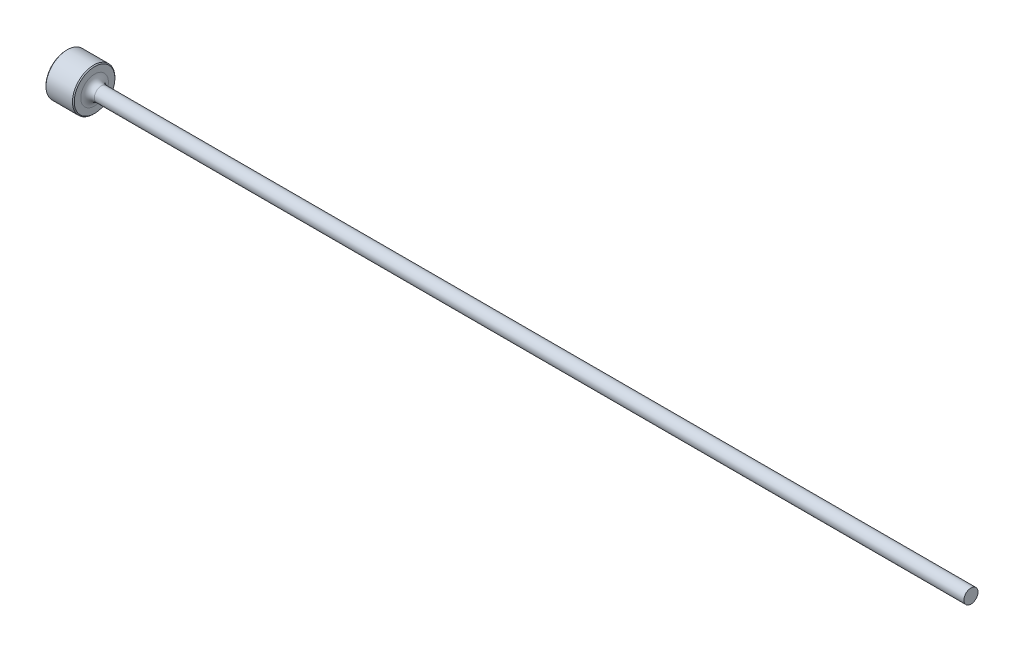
from build123d import *

# Parameters (mm, degrees)
CHAMFER1_SIZE = 0.1016


with BuildPart() as part:
    # Sketch1 → Revolve1 (revolve)
    with BuildSketch(Plane.XY):
        with BuildLine():
            Line((0, 0), (0, 2.38125))
            Line((0, 2.38125), (3.175, 2.38125))
            Line((3.175, 2.38125), (3.175, 1.55194))
            ThreePointArc((3.175, 1.55194), (3.398184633, 1.013124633), (3.937, 0.78994))
            Line((3.937, 0.78994), (101.6, 0.78994))
            Line((101.6, 0.78994), (101.6, 0))
            Line((101.6, 0), (0, 0))
        make_face()
    revolve(axis=Axis((101.6, 0, 0), (-1, 0, 0)))

    # Chamfer1
    chamfer1_edges = [part.edges().sort_by_distance(p)[0] for p in [
        (0, -2.38125, 0),
        (3.175, -2.38125, 0),
    ]]
    chamfer(chamfer1_edges, length=CHAMFER1_SIZE)


solid = part.part
